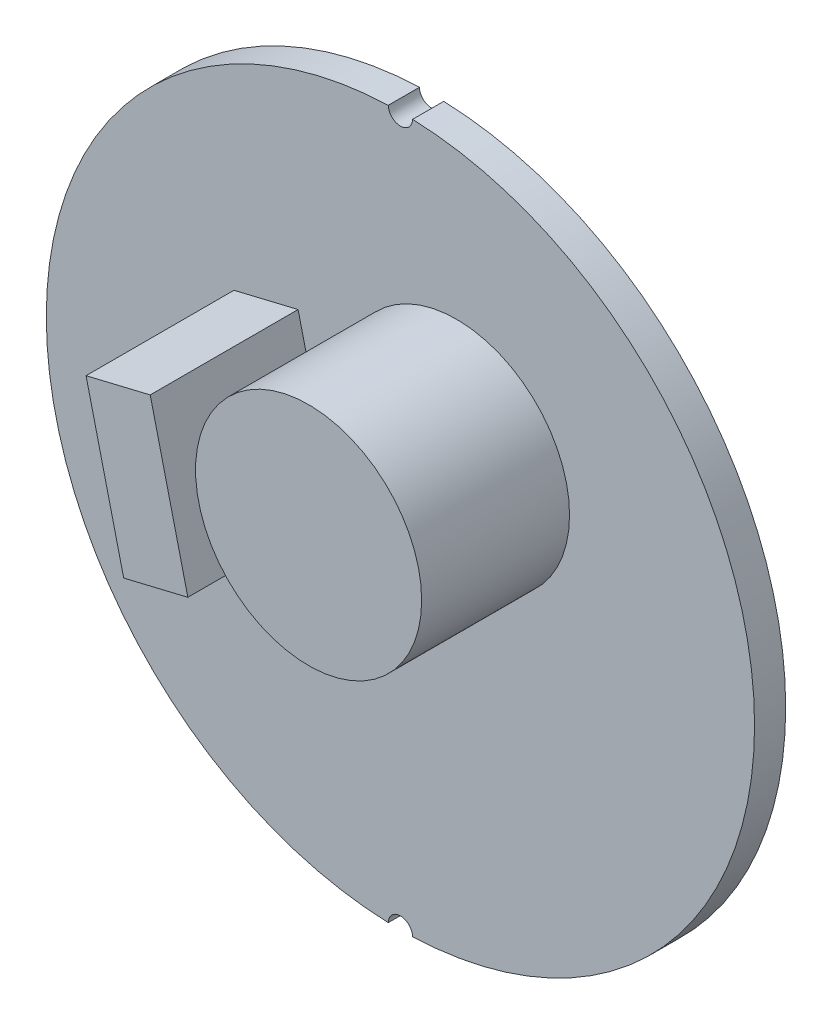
ISO-10303-21;
HEADER;
FILE_DESCRIPTION(('STEP AP214'),'2;1');
FILE_NAME('part.step','',(''),(''),'','','');
FILE_SCHEMA(('AUTOMOTIVE_DESIGN { 1 0 10303 214 1 1 1 1 }'));
ENDSEC;
DATA;
#1=APPLICATION_CONTEXT('core data for automotive mechanical design processes');
#2=APPLICATION_PROTOCOL_DEFINITION('international standard','automotive_design',2000,#1);
#3=PRODUCT_CONTEXT('',#1,'mechanical');
#4=PRODUCT('Part','Part','',(#3));
#5=PRODUCT_RELATED_PRODUCT_CATEGORY('part','',(#4));
#6=PRODUCT_DEFINITION_FORMATION('','',#4);
#7=PRODUCT_DEFINITION_CONTEXT('part definition',#1,'design');
#8=PRODUCT_DEFINITION('design','',#6,#7);
#9=PRODUCT_DEFINITION_SHAPE('','',#8);
#10=(LENGTH_UNIT() NAMED_UNIT(*) SI_UNIT(.MILLI.,.METRE.));
#11=(NAMED_UNIT(*) PLANE_ANGLE_UNIT() SI_UNIT($,.RADIAN.));
#12=(NAMED_UNIT(*) SI_UNIT($,.STERADIAN.) SOLID_ANGLE_UNIT());
#13=UNCERTAINTY_MEASURE_WITH_UNIT(LENGTH_MEASURE(1.E-05),#10,'distance_accuracy_value','');
#14=(GEOMETRIC_REPRESENTATION_CONTEXT(3) GLOBAL_UNCERTAINTY_ASSIGNED_CONTEXT((#13)) GLOBAL_UNIT_ASSIGNED_CONTEXT((#10,
#11,#12)) REPRESENTATION_CONTEXT('',''));
#15=CARTESIAN_POINT('',(0.,0.,0.));
#16=DIRECTION('',(0.,0.,1.));
#17=DIRECTION('',(1.,0.,0.));
#18=AXIS2_PLACEMENT_3D('',#15,#16,#17);
#19=CARTESIAN_POINT('',(0.,0.,2.032));
#20=DIRECTION('',(0.,0.,-1.));
#21=DIRECTION('',(-1.,0.,0.));
#22=AXIS2_PLACEMENT_3D('',#19,#20,#21);
#23=CYLINDRICAL_SURFACE('',#22,23.114);
#24=CARTESIAN_POINT('',(0.,0.,0.));
#25=DIRECTION('',(0.,0.,1.));
#26=DIRECTION('',(1.,0.,0.));
#27=AXIS2_PLACEMENT_3D('',#24,#25,#26);
#28=CIRCLE('',#27,23.114);
#29=CARTESIAN_POINT('',(-0.793632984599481,23.1003710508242,0.));
#30=VERTEX_POINT('',#29);
#31=CARTESIAN_POINT('',(-0.793632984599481,-23.1003710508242,0.));
#32=VERTEX_POINT('',#31);
#33=EDGE_CURVE('E114',#30,#32,#28,.T.);
#34=ORIENTED_EDGE('',*,*,#33,.T.);
#35=DIRECTION('',(0.,0.,1.));
#36=VECTOR('',#35,1.);
#37=CARTESIAN_POINT('',(-0.793632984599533,-23.1003710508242,-2.794));
#38=LINE('',#37,#36);
#39=CARTESIAN_POINT('',(-0.793632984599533,-23.1003710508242,2.032));
#40=VERTEX_POINT('',#39);
#41=EDGE_CURVE('E49',#32,#40,#38,.T.);
#42=ORIENTED_EDGE('',*,*,#41,.T.);
#43=CARTESIAN_POINT('',(0.,0.,2.032));
#44=DIRECTION('',(0.,0.,1.));
#45=DIRECTION('',(1.,0.,0.));
#46=AXIS2_PLACEMENT_3D('',#43,#44,#45);
#47=CIRCLE('',#46,23.114);
#48=CARTESIAN_POINT('',(-0.793632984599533,23.1003710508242,2.032));
#49=VERTEX_POINT('',#48);
#50=EDGE_CURVE('E111',#49,#40,#47,.T.);
#51=ORIENTED_EDGE('',*,*,#50,.F.);
#52=DIRECTION('',(0.,0.,1.));
#53=VECTOR('',#52,1.);
#54=CARTESIAN_POINT('',(-0.793632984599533,23.1003710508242,-2.794));
#55=LINE('',#54,#53);
#56=EDGE_CURVE('E128',#49,#30,#55,.F.);
#57=ORIENTED_EDGE('',*,*,#56,.T.);
#58=EDGE_LOOP('',(#34,#42,#51,#57));
#59=FACE_BOUND('',#58,.T.);
#60=ADVANCED_FACE('F34',(#59),#23,.T.);
#61=CARTESIAN_POINT('',(0.,0.,2.032));
#62=DIRECTION('',(0.,0.,1.));
#63=DIRECTION('',(1.,0.,0.));
#64=AXIS2_PLACEMENT_3D('',#61,#62,#63);
#65=PLANE('',#64);
#66=CARTESIAN_POINT('',(0.,-23.114,2.032));
#67=DIRECTION('',(0.,0.,1.));
#68=DIRECTION('',(1.,0.,0.));
#69=AXIS2_PLACEMENT_3D('',#66,#67,#68);
#70=CIRCLE('',#69,0.79375);
#71=CARTESIAN_POINT('',(0.793632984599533,-23.1003710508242,2.032));
#72=VERTEX_POINT('',#71);
#73=EDGE_CURVE('E100',#72,#40,#70,.T.);
#74=ORIENTED_EDGE('',*,*,#73,.F.);
#75=CARTESIAN_POINT('',(0.793632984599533,23.1003710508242,2.032));
#76=VERTEX_POINT('',#75);
#77=EDGE_CURVE('E108',#72,#76,#47,.T.);
#78=ORIENTED_EDGE('',*,*,#77,.T.);
#79=CARTESIAN_POINT('',(0.,23.114,2.032));
#80=DIRECTION('',(0.,0.,1.));
#81=DIRECTION('',(1.,0.,0.));
#82=AXIS2_PLACEMENT_3D('',#79,#80,#81);
#83=CIRCLE('',#82,0.79375);
#84=EDGE_CURVE('E130',#49,#76,#83,.T.);
#85=ORIENTED_EDGE('',*,*,#84,.F.);
#86=ORIENTED_EDGE('',*,*,#50,.T.);
#87=EDGE_LOOP('',(#74,#78,#85,#86));
#88=FACE_BOUND('',#87,.T.);
#89=CARTESIAN_POINT('',(3.65750760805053,5.85731290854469,2.032));
#90=DIRECTION('',(0.,0.,1.));
#91=DIRECTION('',(1.,0.,0.));
#92=AXIS2_PLACEMENT_3D('',#89,#90,#91);
#93=CIRCLE('',#92,7.37945414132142);
#94=CARTESIAN_POINT('',(11.036961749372,5.85731290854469,2.032));
#95=VERTEX_POINT('',#94);
#96=EDGE_CURVE('E119',#95,#95,#93,.T.);
#97=ORIENTED_EDGE('',*,*,#96,.F.);
#98=EDGE_LOOP('',(#97));
#99=FACE_BOUND('',#98,.T.);
#100=DIRECTION('',(0.972275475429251,0.233838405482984,0.));
#101=VECTOR('',#100,1.);
#102=CARTESIAN_POINT('',(-8.41059425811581,-2.60487560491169,2.032));
#103=LINE('',#102,#101);
#104=CARTESIAN_POINT('',(-8.41059425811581,-2.60487560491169,2.032));
#105=VERTEX_POINT('',#104);
#106=CARTESIAN_POINT('',(-4.22301308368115,-1.59773582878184,2.032));
#107=VERTEX_POINT('',#106);
#108=EDGE_CURVE('E150',#105,#107,#103,.T.);
#109=ORIENTED_EDGE('',*,*,#108,.F.);
#110=DIRECTION('',(0.233838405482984,-0.972275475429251,0.));
#111=VECTOR('',#110,1.);
#112=CARTESIAN_POINT('',(-10.8665081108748,7.60655567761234,2.032));
#113=LINE('',#112,#111);
#114=CARTESIAN_POINT('',(-10.8665081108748,7.60655567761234,2.032));
#115=VERTEX_POINT('',#114);
#116=EDGE_CURVE('E132',#115,#105,#113,.T.);
#117=ORIENTED_EDGE('',*,*,#116,.F.);
#118=DIRECTION('',(-0.972275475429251,-0.233838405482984,0.));
#119=VECTOR('',#118,1.);
#120=CARTESIAN_POINT('',(-10.8665081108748,7.60655567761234,2.032));
#121=LINE('',#120,#119);
#122=CARTESIAN_POINT('',(-6.67892693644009,8.61369545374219,2.032));
#123=VERTEX_POINT('',#122);
#124=EDGE_CURVE('E141',#123,#115,#121,.T.);
#125=ORIENTED_EDGE('',*,*,#124,.F.);
#126=DIRECTION('',(-0.233838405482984,0.972275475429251,0.));
#127=VECTOR('',#126,1.);
#128=CARTESIAN_POINT('',(-6.67892693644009,8.61369545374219,2.032));
#129=LINE('',#128,#127);
#130=EDGE_CURVE('E152',#107,#123,#129,.T.);
#131=ORIENTED_EDGE('',*,*,#130,.F.);
#132=EDGE_LOOP('',(#109,#117,#125,#131));
#133=FACE_BOUND('',#132,.T.);
#134=ADVANCED_FACE('F105',(#88,#99,#133),#65,.T.);
#135=ORIENTED_EDGE('',*,*,#77,.F.);
#136=DIRECTION('',(0.,0.,1.));
#137=VECTOR('',#136,1.);
#138=CARTESIAN_POINT('',(0.793632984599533,-23.1003710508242,-2.794));
#139=LINE('',#138,#137);
#140=CARTESIAN_POINT('',(0.793632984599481,-23.1003710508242,0.));
#141=VERTEX_POINT('',#140);
#142=EDGE_CURVE('E97',#72,#141,#139,.F.);
#143=ORIENTED_EDGE('',*,*,#142,.T.);
#144=CARTESIAN_POINT('',(0.793632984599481,23.1003710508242,0.));
#145=VERTEX_POINT('',#144);
#146=EDGE_CURVE('E56',#141,#145,#28,.T.);
#147=ORIENTED_EDGE('',*,*,#146,.T.);
#148=DIRECTION('',(0.,0.,1.));
#149=VECTOR('',#148,1.);
#150=CARTESIAN_POINT('',(0.793632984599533,23.1003710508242,-2.794));
#151=LINE('',#150,#149);
#152=EDGE_CURVE('E113',#145,#76,#151,.T.);
#153=ORIENTED_EDGE('',*,*,#152,.T.);
#154=EDGE_LOOP('',(#135,#143,#147,#153));
#155=FACE_BOUND('',#154,.T.);
#156=ADVANCED_FACE('F36',(#155),#23,.T.);
#157=CARTESIAN_POINT('',(0.,0.,0.));
#158=DIRECTION('',(0.,0.,1.));
#159=DIRECTION('',(1.,0.,0.));
#160=AXIS2_PLACEMENT_3D('',#157,#158,#159);
#161=PLANE('',#160);
#162=ORIENTED_EDGE('',*,*,#146,.F.);
#163=CARTESIAN_POINT('',(0.,-23.114,0.));
#164=DIRECTION('',(0.,0.,1.));
#165=DIRECTION('',(1.,0.,0.));
#166=AXIS2_PLACEMENT_3D('',#163,#164,#165);
#167=CIRCLE('',#166,0.79375);
#168=EDGE_CURVE('E11',#141,#32,#167,.T.);
#169=ORIENTED_EDGE('',*,*,#168,.T.);
#170=ORIENTED_EDGE('',*,*,#33,.F.);
#171=CARTESIAN_POINT('',(0.,23.114,0.));
#172=DIRECTION('',(0.,0.,1.));
#173=DIRECTION('',(1.,0.,0.));
#174=AXIS2_PLACEMENT_3D('',#171,#172,#173);
#175=CIRCLE('',#174,0.79375);
#176=EDGE_CURVE('E42',#30,#145,#175,.T.);
#177=ORIENTED_EDGE('',*,*,#176,.T.);
#178=EDGE_LOOP('',(#162,#169,#170,#177));
#179=FACE_BOUND('',#178,.T.);
#180=ADVANCED_FACE('F124',(#179),#161,.F.);
#181=CARTESIAN_POINT('',(3.65750760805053,5.85731290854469,11.684));
#182=DIRECTION('',(0.,0.,-1.));
#183=DIRECTION('',(-1.,0.,0.));
#184=AXIS2_PLACEMENT_3D('',#181,#182,#183);
#185=CYLINDRICAL_SURFACE('',#184,7.37945414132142);
#186=CARTESIAN_POINT('',(3.65750760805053,5.85731290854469,11.684));
#187=DIRECTION('',(0.,0.,1.));
#188=DIRECTION('',(1.,0.,0.));
#189=AXIS2_PLACEMENT_3D('',#186,#187,#188);
#190=CIRCLE('',#189,7.37945414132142);
#191=CARTESIAN_POINT('',(11.036961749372,5.85731290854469,11.684));
#192=VERTEX_POINT('',#191);
#193=EDGE_CURVE('E164',#192,#192,#190,.T.);
#194=ORIENTED_EDGE('',*,*,#193,.F.);
#195=EDGE_LOOP('',(#194));
#196=FACE_BOUND('',#195,.T.);
#197=ORIENTED_EDGE('',*,*,#96,.T.);
#198=EDGE_LOOP('',(#197));
#199=FACE_BOUND('',#198,.T.);
#200=ADVANCED_FACE('F171',(#196,#199),#185,.T.);
#201=CARTESIAN_POINT('',(3.65750760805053,5.85731290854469,11.684));
#202=DIRECTION('',(0.,0.,1.));
#203=DIRECTION('',(1.,0.,0.));
#204=AXIS2_PLACEMENT_3D('',#201,#202,#203);
#205=PLANE('',#204);
#206=ORIENTED_EDGE('',*,*,#193,.T.);
#207=EDGE_LOOP('',(#206));
#208=FACE_BOUND('',#207,.T.);
#209=ADVANCED_FACE('F214',(#208),#205,.T.);
#210=CARTESIAN_POINT('',(-10.8665081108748,7.60655567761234,11.684));
#211=DIRECTION('',(0.972275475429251,0.233838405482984,0.));
#212=DIRECTION('',(-0.233838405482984,0.972275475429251,0.));
#213=AXIS2_PLACEMENT_3D('',#210,#211,#212);
#214=PLANE('',#213);
#215=ORIENTED_EDGE('',*,*,#116,.T.);
#216=DIRECTION('',(0.,0.,-1.));
#217=VECTOR('',#216,1.);
#218=CARTESIAN_POINT('',(-8.41059425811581,-2.60487560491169,11.684));
#219=LINE('',#218,#217);
#220=CARTESIAN_POINT('',(-8.41059425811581,-2.60487560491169,11.684));
#221=VERTEX_POINT('',#220);
#222=EDGE_CURVE('E163',#221,#105,#219,.T.);
#223=ORIENTED_EDGE('',*,*,#222,.F.);
#224=DIRECTION('',(0.233838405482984,-0.972275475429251,0.));
#225=VECTOR('',#224,1.);
#226=CARTESIAN_POINT('',(-10.8665081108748,7.60655567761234,11.684));
#227=LINE('',#226,#225);
#228=CARTESIAN_POINT('',(-10.8665081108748,7.60655567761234,11.684));
#229=VERTEX_POINT('',#228);
#230=EDGE_CURVE('E137',#229,#221,#227,.T.);
#231=ORIENTED_EDGE('',*,*,#230,.F.);
#232=DIRECTION('',(0.,0.,-1.));
#233=VECTOR('',#232,1.);
#234=CARTESIAN_POINT('',(-10.8665081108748,7.60655567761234,11.684));
#235=LINE('',#234,#233);
#236=EDGE_CURVE('E147',#229,#115,#235,.T.);
#237=ORIENTED_EDGE('',*,*,#236,.T.);
#238=EDGE_LOOP('',(#215,#223,#231,#237));
#239=FACE_BOUND('',#238,.T.);
#240=ADVANCED_FACE('F193',(#239),#214,.F.);
#241=CARTESIAN_POINT('',(-8.41059425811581,-2.60487560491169,11.684));
#242=DIRECTION('',(-0.233838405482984,0.972275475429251,0.));
#243=DIRECTION('',(-0.972275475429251,-0.233838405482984,0.));
#244=AXIS2_PLACEMENT_3D('',#241,#242,#243);
#245=PLANE('',#244);
#246=ORIENTED_EDGE('',*,*,#108,.T.);
#247=DIRECTION('',(0.,0.,-1.));
#248=VECTOR('',#247,1.);
#249=CARTESIAN_POINT('',(-4.22301308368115,-1.59773582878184,11.684));
#250=LINE('',#249,#248);
#251=CARTESIAN_POINT('',(-4.22301308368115,-1.59773582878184,11.684));
#252=VERTEX_POINT('',#251);
#253=EDGE_CURVE('E160',#252,#107,#250,.T.);
#254=ORIENTED_EDGE('',*,*,#253,.F.);
#255=DIRECTION('',(0.972275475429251,0.233838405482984,0.));
#256=VECTOR('',#255,1.);
#257=CARTESIAN_POINT('',(-8.41059425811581,-2.60487560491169,11.684));
#258=LINE('',#257,#256);
#259=EDGE_CURVE('E140',#221,#252,#258,.T.);
#260=ORIENTED_EDGE('',*,*,#259,.F.);
#261=ORIENTED_EDGE('',*,*,#222,.T.);
#262=EDGE_LOOP('',(#246,#254,#260,#261));
#263=FACE_BOUND('',#262,.T.);
#264=ADVANCED_FACE('F181',(#263),#245,.F.);
#265=CARTESIAN_POINT('',(-6.67892693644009,8.61369545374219,11.684));
#266=DIRECTION('',(-0.972275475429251,-0.233838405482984,0.));
#267=DIRECTION('',(0.233838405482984,-0.972275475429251,0.));
#268=AXIS2_PLACEMENT_3D('',#265,#266,#267);
#269=PLANE('',#268);
#270=ORIENTED_EDGE('',*,*,#130,.T.);
#271=DIRECTION('',(0.,0.,-1.));
#272=VECTOR('',#271,1.);
#273=CARTESIAN_POINT('',(-6.67892693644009,8.61369545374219,11.684));
#274=LINE('',#273,#272);
#275=CARTESIAN_POINT('',(-6.67892693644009,8.61369545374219,11.684));
#276=VERTEX_POINT('',#275);
#277=EDGE_CURVE('E158',#276,#123,#274,.T.);
#278=ORIENTED_EDGE('',*,*,#277,.F.);
#279=DIRECTION('',(-0.233838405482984,0.972275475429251,0.));
#280=VECTOR('',#279,1.);
#281=CARTESIAN_POINT('',(-6.67892693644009,8.61369545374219,11.684));
#282=LINE('',#281,#280);
#283=EDGE_CURVE('E143',#252,#276,#282,.T.);
#284=ORIENTED_EDGE('',*,*,#283,.F.);
#285=ORIENTED_EDGE('',*,*,#253,.T.);
#286=EDGE_LOOP('',(#270,#278,#284,#285));
#287=FACE_BOUND('',#286,.T.);
#288=ADVANCED_FACE('F185',(#287),#269,.F.);
#289=CARTESIAN_POINT('',(-10.8665081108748,7.60655567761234,11.684));
#290=DIRECTION('',(0.233838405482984,-0.972275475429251,0.));
#291=DIRECTION('',(0.972275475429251,0.233838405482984,0.));
#292=AXIS2_PLACEMENT_3D('',#289,#290,#291);
#293=PLANE('',#292);
#294=ORIENTED_EDGE('',*,*,#124,.T.);
#295=ORIENTED_EDGE('',*,*,#236,.F.);
#296=DIRECTION('',(-0.972275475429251,-0.233838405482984,0.));
#297=VECTOR('',#296,1.);
#298=CARTESIAN_POINT('',(-10.8665081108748,7.60655567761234,11.684));
#299=LINE('',#298,#297);
#300=EDGE_CURVE('E145',#276,#229,#299,.T.);
#301=ORIENTED_EDGE('',*,*,#300,.F.);
#302=ORIENTED_EDGE('',*,*,#277,.T.);
#303=EDGE_LOOP('',(#294,#295,#301,#302));
#304=FACE_BOUND('',#303,.T.);
#305=ADVANCED_FACE('F195',(#304),#293,.F.);
#306=CARTESIAN_POINT('',(0.,0.,11.684));
#307=DIRECTION('',(0.,0.,1.));
#308=DIRECTION('',(1.,0.,0.));
#309=AXIS2_PLACEMENT_3D('',#306,#307,#308);
#310=PLANE('',#309);
#311=ORIENTED_EDGE('',*,*,#230,.T.);
#312=ORIENTED_EDGE('',*,*,#259,.T.);
#313=ORIENTED_EDGE('',*,*,#283,.T.);
#314=ORIENTED_EDGE('',*,*,#300,.T.);
#315=EDGE_LOOP('',(#311,#312,#313,#314));
#316=FACE_BOUND('',#315,.T.);
#317=ADVANCED_FACE('F189',(#316),#310,.T.);
#318=CARTESIAN_POINT('',(0.,23.114,-7.62));
#319=DIRECTION('',(0.,0.,1.));
#320=DIRECTION('',(1.,0.,0.));
#321=AXIS2_PLACEMENT_3D('',#318,#319,#320);
#322=CYLINDRICAL_SURFACE('',#321,0.79375);
#323=ORIENTED_EDGE('',*,*,#176,.F.);
#324=ORIENTED_EDGE('',*,*,#56,.F.);
#325=ORIENTED_EDGE('',*,*,#84,.T.);
#326=ORIENTED_EDGE('',*,*,#152,.F.);
#327=EDGE_LOOP('',(#323,#324,#325,#326));
#328=FACE_BOUND('',#327,.T.);
#329=ADVANCED_FACE('F127',(#328),#322,.F.);
#330=CARTESIAN_POINT('',(0.,-23.114,-7.62));
#331=DIRECTION('',(0.,0.,1.));
#332=DIRECTION('',(1.,0.,0.));
#333=AXIS2_PLACEMENT_3D('',#330,#331,#332);
#334=CYLINDRICAL_SURFACE('',#333,0.79375);
#335=ORIENTED_EDGE('',*,*,#168,.F.);
#336=ORIENTED_EDGE('',*,*,#142,.F.);
#337=ORIENTED_EDGE('',*,*,#73,.T.);
#338=ORIENTED_EDGE('',*,*,#41,.F.);
#339=EDGE_LOOP('',(#335,#336,#337,#338));
#340=FACE_BOUND('',#339,.T.);
#341=ADVANCED_FACE('F99',(#340),#334,.F.);
#342=CLOSED_SHELL('',(#60,#134,#156,#180,#200,#209,#240,#264,#288,#305,#317,#329,#341));
#343=MANIFOLD_SOLID_BREP('B2',#342);
#344=ADVANCED_BREP_SHAPE_REPRESENTATION('',(#18,#343),#14);
#345=SHAPE_DEFINITION_REPRESENTATION(#9,#344);
ENDSEC;
END-ISO-10303-21;
